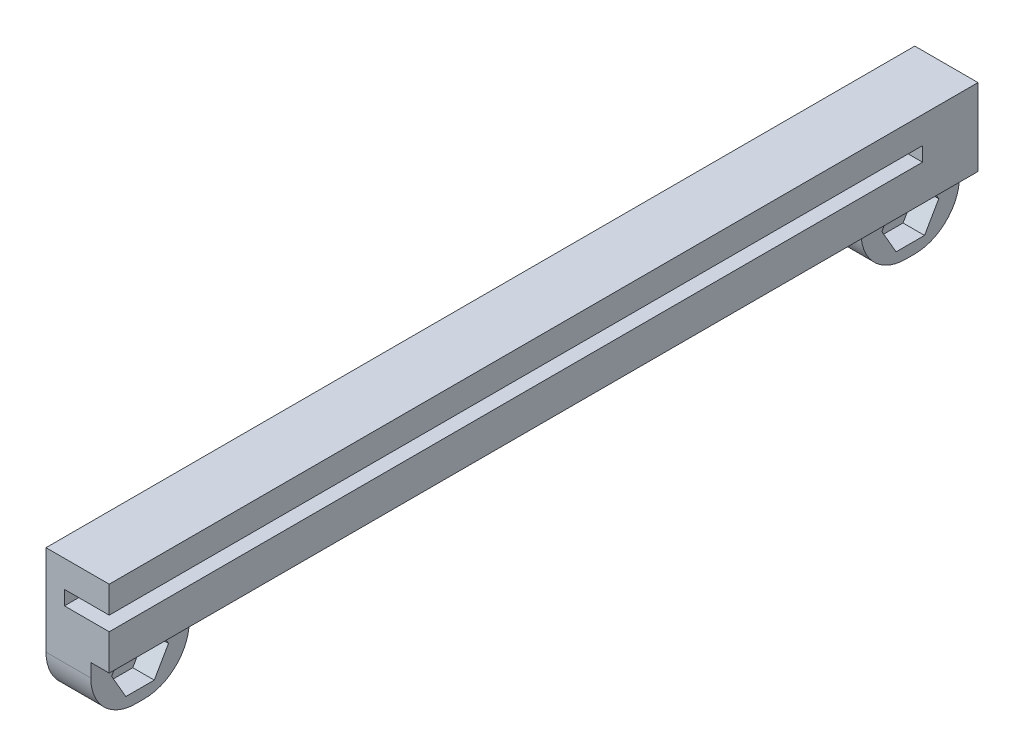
ISO-10303-21;
HEADER;
FILE_DESCRIPTION(('STEP AP214'),'2;1');
FILE_NAME('part.step','',(''),(''),'','','');
FILE_SCHEMA(('AUTOMOTIVE_DESIGN { 1 0 10303 214 1 1 1 1 }'));
ENDSEC;
DATA;
#1=APPLICATION_CONTEXT('core data for automotive mechanical design processes');
#2=APPLICATION_PROTOCOL_DEFINITION('international standard','automotive_design',2000,#1);
#3=PRODUCT_CONTEXT('',#1,'mechanical');
#4=PRODUCT('Part','Part','',(#3));
#5=PRODUCT_RELATED_PRODUCT_CATEGORY('part','',(#4));
#6=PRODUCT_DEFINITION_FORMATION('','',#4);
#7=PRODUCT_DEFINITION_CONTEXT('part definition',#1,'design');
#8=PRODUCT_DEFINITION('design','',#6,#7);
#9=PRODUCT_DEFINITION_SHAPE('','',#8);
#10=(LENGTH_UNIT() NAMED_UNIT(*) SI_UNIT(.MILLI.,.METRE.));
#11=(NAMED_UNIT(*) PLANE_ANGLE_UNIT() SI_UNIT($,.RADIAN.));
#12=(NAMED_UNIT(*) SI_UNIT($,.STERADIAN.) SOLID_ANGLE_UNIT());
#13=UNCERTAINTY_MEASURE_WITH_UNIT(LENGTH_MEASURE(1.E-05),#10,'distance_accuracy_value','');
#14=(GEOMETRIC_REPRESENTATION_CONTEXT(3) GLOBAL_UNCERTAINTY_ASSIGNED_CONTEXT((#13)) GLOBAL_UNIT_ASSIGNED_CONTEXT((#10,
#11,#12)) REPRESENTATION_CONTEXT('',''));
#15=CARTESIAN_POINT('',(0.,0.,0.));
#16=DIRECTION('',(0.,0.,1.));
#17=DIRECTION('',(1.,0.,0.));
#18=AXIS2_PLACEMENT_3D('',#15,#16,#17);
#19=CARTESIAN_POINT('',(3.52875,7.6,48.5));
#20=DIRECTION('',(-1.,0.,0.));
#21=DIRECTION('',(0.,0.,1.));
#22=AXIS2_PLACEMENT_3D('',#19,#20,#21);
#23=PLANE('',#22);
#24=DIRECTION('',(0.,0.,-1.));
#25=VECTOR('',#24,1.);
#26=CARTESIAN_POINT('',(3.52875,7.6,48.5));
#27=LINE('',#26,#25);
#28=CARTESIAN_POINT('',(3.52875000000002,7.6,48.5));
#29=VERTEX_POINT('',#28);
#30=CARTESIAN_POINT('',(3.52875,7.6,-48.5));
#31=VERTEX_POINT('',#30);
#32=EDGE_CURVE('E505',#29,#31,#27,.T.);
#33=ORIENTED_EDGE('',*,*,#32,.F.);
#34=DIRECTION('',(0.,1.,0.));
#35=VECTOR('',#34,1.);
#36=CARTESIAN_POINT('',(3.52875000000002,4.6,48.5));
#37=LINE('',#36,#35);
#38=CARTESIAN_POINT('',(3.52875000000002,4.6,48.5));
#39=VERTEX_POINT('',#38);
#40=EDGE_CURVE('E481',#39,#29,#37,.T.);
#41=ORIENTED_EDGE('',*,*,#40,.F.);
#42=DIRECTION('',(0.,0.,-1.));
#43=VECTOR('',#42,1.);
#44=CARTESIAN_POINT('',(3.52875,4.6,-42.305));
#45=LINE('',#44,#43);
#46=CARTESIAN_POINT('',(3.52875,4.6,-42.305));
#47=VERTEX_POINT('',#46);
#48=EDGE_CURVE('E467',#39,#47,#45,.T.);
#49=ORIENTED_EDGE('',*,*,#48,.T.);
#50=DIRECTION('',(0.,1.,0.));
#51=VECTOR('',#50,1.);
#52=CARTESIAN_POINT('',(3.52875,3.,-42.305));
#53=LINE('',#52,#51);
#54=CARTESIAN_POINT('',(3.52875,3.,-42.305));
#55=VERTEX_POINT('',#54);
#56=EDGE_CURVE('E500',#55,#47,#53,.T.);
#57=ORIENTED_EDGE('',*,*,#56,.F.);
#58=DIRECTION('',(0.,0.,-1.));
#59=VECTOR('',#58,1.);
#60=CARTESIAN_POINT('',(3.52875,3.,-42.305));
#61=LINE('',#60,#59);
#62=CARTESIAN_POINT('',(3.52875000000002,3.,48.5));
#63=VERTEX_POINT('',#62);
#64=EDGE_CURVE('E485',#63,#55,#61,.T.);
#65=ORIENTED_EDGE('',*,*,#64,.F.);
#66=DIRECTION('',(0.,-1.,0.));
#67=VECTOR('',#66,1.);
#68=CARTESIAN_POINT('',(3.52875,7.6,48.5));
#69=LINE('',#68,#67);
#70=CARTESIAN_POINT('',(3.52874999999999,-1.,48.5));
#71=VERTEX_POINT('',#70);
#72=EDGE_CURVE('E523',#63,#71,#69,.T.);
#73=ORIENTED_EDGE('',*,*,#72,.T.);
#74=DIRECTION('',(0.,0.,1.));
#75=VECTOR('',#74,1.);
#76=CARTESIAN_POINT('',(3.52874999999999,-1.,48.5));
#77=LINE('',#76,#75);
#78=CARTESIAN_POINT('',(3.52875,-1.,-48.5));
#79=VERTEX_POINT('',#78);
#80=EDGE_CURVE('E459',#79,#71,#77,.T.);
#81=ORIENTED_EDGE('',*,*,#80,.F.);
#82=DIRECTION('',(0.,-1.,0.));
#83=VECTOR('',#82,1.);
#84=CARTESIAN_POINT('',(3.52875,7.6,-48.5));
#85=LINE('',#84,#83);
#86=EDGE_CURVE('E534',#31,#79,#85,.T.);
#87=ORIENTED_EDGE('',*,*,#86,.F.);
#88=EDGE_LOOP('',(#33,#41,#49,#57,#65,#73,#81,#87));
#89=FACE_BOUND('',#88,.T.);
#90=ADVANCED_FACE('F38',(#89),#23,.F.);
#91=CARTESIAN_POINT('',(-3.52875000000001,7.6,-48.5));
#92=DIRECTION('',(0.,0.,1.));
#93=DIRECTION('',(1.,0.,0.));
#94=AXIS2_PLACEMENT_3D('',#91,#92,#93);
#95=PLANE('',#94);
#96=DIRECTION('',(0.,1.,0.));
#97=VECTOR('',#96,1.);
#98=CARTESIAN_POINT('',(1.47125,-7.5,-48.5));
#99=LINE('',#98,#97);
#100=CARTESIAN_POINT('',(1.47125,-2.5,-48.5));
#101=VERTEX_POINT('',#100);
#102=CARTESIAN_POINT('',(1.47125,-1.,-48.5));
#103=VERTEX_POINT('',#102);
#104=EDGE_CURVE('E404',#101,#103,#99,.T.);
#105=ORIENTED_EDGE('',*,*,#104,.F.);
#106=DIRECTION('',(1.,0.,0.));
#107=VECTOR('',#106,1.);
#108=CARTESIAN_POINT('',(-3.52875,-2.5,-48.5));
#109=LINE('',#108,#107);
#110=CARTESIAN_POINT('',(-3.52875000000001,-2.5,-48.5));
#111=VERTEX_POINT('',#110);
#112=EDGE_CURVE('E558',#101,#111,#109,.F.);
#113=ORIENTED_EDGE('',*,*,#112,.T.);
#114=DIRECTION('',(0.,-1.,0.));
#115=VECTOR('',#114,1.);
#116=CARTESIAN_POINT('',(-3.52875000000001,7.6,-48.5));
#117=LINE('',#116,#115);
#118=CARTESIAN_POINT('',(-3.52875000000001,7.6,-48.5));
#119=VERTEX_POINT('',#118);
#120=EDGE_CURVE('E530',#119,#111,#117,.T.);
#121=ORIENTED_EDGE('',*,*,#120,.F.);
#122=DIRECTION('',(-1.,0.,0.));
#123=VECTOR('',#122,1.);
#124=CARTESIAN_POINT('',(-3.52875000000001,7.6,-48.5));
#125=LINE('',#124,#123);
#126=EDGE_CURVE('E514',#31,#119,#125,.T.);
#127=ORIENTED_EDGE('',*,*,#126,.F.);
#128=ORIENTED_EDGE('',*,*,#86,.T.);
#129=DIRECTION('',(1.,0.,0.));
#130=VECTOR('',#129,1.);
#131=CARTESIAN_POINT('',(-3.52875,-1.,-48.5));
#132=LINE('',#131,#130);
#133=EDGE_CURVE('E456',#103,#79,#132,.T.);
#134=ORIENTED_EDGE('',*,*,#133,.F.);
#135=EDGE_LOOP('',(#105,#113,#121,#127,#128,#134));
#136=FACE_BOUND('',#135,.T.);
#137=ADVANCED_FACE('F627',(#136),#95,.F.);
#138=CARTESIAN_POINT('',(-3.52875000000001,7.6,48.5));
#139=DIRECTION('',(1.,0.,0.));
#140=DIRECTION('',(0.,0.,-1.));
#141=AXIS2_PLACEMENT_3D('',#138,#139,#140);
#142=PLANE('',#141);
#143=CARTESIAN_POINT('',(-3.52875000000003,-3.5,43.));
#144=DIRECTION('',(1.,0.,0.));
#145=DIRECTION('',(0.,0.,-1.));
#146=AXIS2_PLACEMENT_3D('',#143,#144,#145);
#147=CIRCLE('',#146,1.6);
#148=CARTESIAN_POINT('',(-3.52875000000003,-3.5,41.4));
#149=VERTEX_POINT('',#148);
#150=EDGE_CURVE('E361',#149,#149,#147,.T.);
#151=ORIENTED_EDGE('',*,*,#150,.T.);
#152=EDGE_LOOP('',(#151));
#153=FACE_BOUND('',#152,.T.);
#154=CARTESIAN_POINT('',(-3.52875000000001,-3.5,-43.));
#155=DIRECTION('',(1.,0.,0.));
#156=DIRECTION('',(0.,0.,-1.));
#157=AXIS2_PLACEMENT_3D('',#154,#155,#156);
#158=CIRCLE('',#157,1.6);
#159=CARTESIAN_POINT('',(-3.52875000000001,-3.5,-44.6));
#160=VERTEX_POINT('',#159);
#161=EDGE_CURVE('E284',#160,#160,#158,.T.);
#162=ORIENTED_EDGE('',*,*,#161,.T.);
#163=EDGE_LOOP('',(#162));
#164=FACE_BOUND('',#163,.T.);
#165=ORIENTED_EDGE('',*,*,#120,.T.);
#166=CARTESIAN_POINT('',(-3.52875000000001,-2.5,-43.5));
#167=DIRECTION('',(1.,0.,0.));
#168=DIRECTION('',(0.,0.,-1.));
#169=AXIS2_PLACEMENT_3D('',#166,#167,#168);
#170=CIRCLE('',#169,5.);
#171=CARTESIAN_POINT('',(-3.52875,-7.5,-43.5));
#172=VERTEX_POINT('',#171);
#173=EDGE_CURVE('E570',#111,#172,#170,.F.);
#174=ORIENTED_EDGE('',*,*,#173,.T.);
#175=DIRECTION('',(0.,0.,1.));
#176=VECTOR('',#175,1.);
#177=CARTESIAN_POINT('',(-3.52875,-7.5,-48.5));
#178=LINE('',#177,#176);
#179=CARTESIAN_POINT('',(-3.52875,-7.5,-42.5));
#180=VERTEX_POINT('',#179);
#181=EDGE_CURVE('E403',#172,#180,#178,.T.);
#182=ORIENTED_EDGE('',*,*,#181,.T.);
#183=CARTESIAN_POINT('',(-3.52875000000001,-2.5,-42.5));
#184=DIRECTION('',(1.,0.,0.));
#185=DIRECTION('',(0.,0.,-1.));
#186=AXIS2_PLACEMENT_3D('',#183,#184,#185);
#187=CIRCLE('',#186,5.);
#188=CARTESIAN_POINT('',(-3.52875,-2.5,-37.5));
#189=VERTEX_POINT('',#188);
#190=EDGE_CURVE('E567',#180,#189,#187,.F.);
#191=ORIENTED_EDGE('',*,*,#190,.T.);
#192=DIRECTION('',(0.,1.,0.));
#193=VECTOR('',#192,1.);
#194=CARTESIAN_POINT('',(-3.52875,-7.5,-37.5));
#195=LINE('',#194,#193);
#196=CARTESIAN_POINT('',(-3.52875,-1.,-37.5));
#197=VERTEX_POINT('',#196);
#198=EDGE_CURVE('E319',#189,#197,#195,.T.);
#199=ORIENTED_EDGE('',*,*,#198,.T.);
#200=DIRECTION('',(0.,0.,-1.));
#201=VECTOR('',#200,1.);
#202=CARTESIAN_POINT('',(-3.52875000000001,-1.,48.5));
#203=LINE('',#202,#201);
#204=CARTESIAN_POINT('',(-3.52875000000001,-1.,37.5));
#205=VERTEX_POINT('',#204);
#206=EDGE_CURVE('E452',#205,#197,#203,.T.);
#207=ORIENTED_EDGE('',*,*,#206,.F.);
#208=DIRECTION('',(0.,1.,0.));
#209=VECTOR('',#208,1.);
#210=CARTESIAN_POINT('',(-3.52875000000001,-7.5,37.5));
#211=LINE('',#210,#209);
#212=CARTESIAN_POINT('',(-3.52875000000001,-2.5,37.5));
#213=VERTEX_POINT('',#212);
#214=EDGE_CURVE('E435',#213,#205,#211,.T.);
#215=ORIENTED_EDGE('',*,*,#214,.F.);
#216=CARTESIAN_POINT('',(-3.52875000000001,-2.5,42.5));
#217=DIRECTION('',(1.,0.,0.));
#218=DIRECTION('',(0.,0.,-1.));
#219=AXIS2_PLACEMENT_3D('',#216,#217,#218);
#220=CIRCLE('',#219,5.);
#221=CARTESIAN_POINT('',(-3.52875000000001,-7.5,42.5));
#222=VERTEX_POINT('',#221);
#223=EDGE_CURVE('E564',#213,#222,#220,.F.);
#224=ORIENTED_EDGE('',*,*,#223,.T.);
#225=DIRECTION('',(0.,0.,-1.));
#226=VECTOR('',#225,1.);
#227=CARTESIAN_POINT('',(-3.52875000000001,-7.5,48.5));
#228=LINE('',#227,#226);
#229=CARTESIAN_POINT('',(-3.52875000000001,-7.5,43.5));
#230=VERTEX_POINT('',#229);
#231=EDGE_CURVE('E430',#230,#222,#228,.T.);
#232=ORIENTED_EDGE('',*,*,#231,.F.);
#233=CARTESIAN_POINT('',(-3.52875000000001,-2.5,43.5));
#234=DIRECTION('',(1.,0.,0.));
#235=DIRECTION('',(0.,0.,-1.));
#236=AXIS2_PLACEMENT_3D('',#233,#234,#235);
#237=CIRCLE('',#236,5.);
#238=CARTESIAN_POINT('',(-3.52875000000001,-2.5,48.5));
#239=VERTEX_POINT('',#238);
#240=EDGE_CURVE('E561',#230,#239,#237,.F.);
#241=ORIENTED_EDGE('',*,*,#240,.T.);
#242=DIRECTION('',(0.,-1.,0.));
#243=VECTOR('',#242,1.);
#244=CARTESIAN_POINT('',(-3.52875000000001,7.6,48.5));
#245=LINE('',#244,#243);
#246=CARTESIAN_POINT('',(-3.52875000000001,7.6,48.5));
#247=VERTEX_POINT('',#246);
#248=EDGE_CURVE('E526',#247,#239,#245,.T.);
#249=ORIENTED_EDGE('',*,*,#248,.F.);
#250=DIRECTION('',(0.,0.,1.));
#251=VECTOR('',#250,1.);
#252=CARTESIAN_POINT('',(-3.52875000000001,7.6,48.5));
#253=LINE('',#252,#251);
#254=EDGE_CURVE('E517',#119,#247,#253,.T.);
#255=ORIENTED_EDGE('',*,*,#254,.F.);
#256=EDGE_LOOP('',(#165,#174,#182,#191,#199,#207,#215,#224,#232,#241,#249,#255));
#257=FACE_BOUND('',#256,.T.);
#258=ADVANCED_FACE('F597',(#153,#164,#257),#142,.F.);
#259=CARTESIAN_POINT('',(-3.52875000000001,7.6,48.5));
#260=DIRECTION('',(0.,0.,-1.));
#261=DIRECTION('',(-1.,0.,0.));
#262=AXIS2_PLACEMENT_3D('',#259,#260,#261);
#263=PLANE('',#262);
#264=ORIENTED_EDGE('',*,*,#248,.T.);
#265=DIRECTION('',(1.,0.,0.));
#266=VECTOR('',#265,1.);
#267=CARTESIAN_POINT('',(-3.52875000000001,-2.5,48.5));
#268=LINE('',#267,#266);
#269=CARTESIAN_POINT('',(1.47124999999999,-2.5,48.5));
#270=VERTEX_POINT('',#269);
#271=EDGE_CURVE('E11',#239,#270,#268,.T.);
#272=ORIENTED_EDGE('',*,*,#271,.T.);
#273=DIRECTION('',(0.,1.,0.));
#274=VECTOR('',#273,1.);
#275=CARTESIAN_POINT('',(1.47124999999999,-7.5,48.5));
#276=LINE('',#275,#274);
#277=CARTESIAN_POINT('',(1.47124999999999,-1.,48.5));
#278=VERTEX_POINT('',#277);
#279=EDGE_CURVE('E446',#270,#278,#276,.T.);
#280=ORIENTED_EDGE('',*,*,#279,.T.);
#281=DIRECTION('',(-1.,0.,0.));
#282=VECTOR('',#281,1.);
#283=CARTESIAN_POINT('',(-3.52875000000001,-1.,48.5));
#284=LINE('',#283,#282);
#285=EDGE_CURVE('E463',#71,#278,#284,.T.);
#286=ORIENTED_EDGE('',*,*,#285,.F.);
#287=ORIENTED_EDGE('',*,*,#72,.F.);
#288=DIRECTION('',(1.,0.,0.));
#289=VECTOR('',#288,1.);
#290=CARTESIAN_POINT('',(3.52875000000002,3.,48.5));
#291=LINE('',#290,#289);
#292=CARTESIAN_POINT('',(-1.47125000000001,3.,48.5));
#293=VERTEX_POINT('',#292);
#294=EDGE_CURVE('E497',#293,#63,#291,.T.);
#295=ORIENTED_EDGE('',*,*,#294,.F.);
#296=DIRECTION('',(0.,1.,0.));
#297=VECTOR('',#296,1.);
#298=CARTESIAN_POINT('',(-1.47125000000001,3.,48.5));
#299=LINE('',#298,#297);
#300=CARTESIAN_POINT('',(-1.47125000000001,4.6,48.5));
#301=VERTEX_POINT('',#300);
#302=EDGE_CURVE('E501',#293,#301,#299,.T.);
#303=ORIENTED_EDGE('',*,*,#302,.T.);
#304=DIRECTION('',(1.,0.,0.));
#305=VECTOR('',#304,1.);
#306=CARTESIAN_POINT('',(3.52875000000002,4.6,48.5));
#307=LINE('',#306,#305);
#308=EDGE_CURVE('E477',#301,#39,#307,.T.);
#309=ORIENTED_EDGE('',*,*,#308,.T.);
#310=ORIENTED_EDGE('',*,*,#40,.T.);
#311=DIRECTION('',(1.,0.,0.));
#312=VECTOR('',#311,1.);
#313=CARTESIAN_POINT('',(-3.52875000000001,7.6,48.5));
#314=LINE('',#313,#312);
#315=EDGE_CURVE('E520',#247,#29,#314,.T.);
#316=ORIENTED_EDGE('',*,*,#315,.F.);
#317=EDGE_LOOP('',(#264,#272,#280,#286,#287,#295,#303,#309,#310,#316));
#318=FACE_BOUND('',#317,.T.);
#319=ADVANCED_FACE('F610',(#318),#263,.F.);
#320=CARTESIAN_POINT('',(0.,7.6,0.));
#321=DIRECTION('',(0.,-1.,0.));
#322=DIRECTION('',(0.,0.,-1.));
#323=AXIS2_PLACEMENT_3D('',#320,#321,#322);
#324=PLANE('',#323);
#325=ORIENTED_EDGE('',*,*,#315,.T.);
#326=ORIENTED_EDGE('',*,*,#32,.T.);
#327=ORIENTED_EDGE('',*,*,#126,.T.);
#328=ORIENTED_EDGE('',*,*,#254,.T.);
#329=EDGE_LOOP('',(#325,#326,#327,#328));
#330=FACE_BOUND('',#329,.T.);
#331=ADVANCED_FACE('F618',(#330),#324,.F.);
#332=CARTESIAN_POINT('',(-1.47125000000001,3.,-42.305));
#333=DIRECTION('',(-1.,0.,0.));
#334=DIRECTION('',(0.,0.,1.));
#335=AXIS2_PLACEMENT_3D('',#332,#333,#334);
#336=PLANE('',#335);
#337=DIRECTION('',(0.,1.,0.));
#338=VECTOR('',#337,1.);
#339=CARTESIAN_POINT('',(-1.47125000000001,3.,-42.305));
#340=LINE('',#339,#338);
#341=CARTESIAN_POINT('',(-1.47125000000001,3.,-42.305));
#342=VERTEX_POINT('',#341);
#343=CARTESIAN_POINT('',(-1.47125000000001,4.6,-42.305));
#344=VERTEX_POINT('',#343);
#345=EDGE_CURVE('E506',#342,#344,#340,.T.);
#346=ORIENTED_EDGE('',*,*,#345,.T.);
#347=DIRECTION('',(0.,0.,1.));
#348=VECTOR('',#347,1.);
#349=CARTESIAN_POINT('',(-1.47125000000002,4.6,-42.305));
#350=LINE('',#349,#348);
#351=EDGE_CURVE('E474',#344,#301,#350,.T.);
#352=ORIENTED_EDGE('',*,*,#351,.T.);
#353=ORIENTED_EDGE('',*,*,#302,.F.);
#354=DIRECTION('',(0.,0.,1.));
#355=VECTOR('',#354,1.);
#356=CARTESIAN_POINT('',(-1.47125000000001,3.,-42.305));
#357=LINE('',#356,#355);
#358=EDGE_CURVE('E493',#342,#293,#357,.T.);
#359=ORIENTED_EDGE('',*,*,#358,.F.);
#360=EDGE_LOOP('',(#346,#352,#353,#359));
#361=FACE_BOUND('',#360,.T.);
#362=ADVANCED_FACE('F997',(#361),#336,.F.);
#363=CARTESIAN_POINT('',(3.52875,3.,-42.305));
#364=DIRECTION('',(0.,0.,-1.));
#365=DIRECTION('',(-1.,0.,0.));
#366=AXIS2_PLACEMENT_3D('',#363,#364,#365);
#367=PLANE('',#366);
#368=ORIENTED_EDGE('',*,*,#56,.T.);
#369=DIRECTION('',(-1.,0.,0.));
#370=VECTOR('',#369,1.);
#371=CARTESIAN_POINT('',(3.52875,4.6,-42.305));
#372=LINE('',#371,#370);
#373=EDGE_CURVE('E471',#47,#344,#372,.T.);
#374=ORIENTED_EDGE('',*,*,#373,.T.);
#375=ORIENTED_EDGE('',*,*,#345,.F.);
#376=DIRECTION('',(-1.,0.,0.));
#377=VECTOR('',#376,1.);
#378=CARTESIAN_POINT('',(3.52875,3.,-42.305));
#379=LINE('',#378,#377);
#380=EDGE_CURVE('E489',#55,#342,#379,.T.);
#381=ORIENTED_EDGE('',*,*,#380,.F.);
#382=EDGE_LOOP('',(#368,#374,#375,#381));
#383=FACE_BOUND('',#382,.T.);
#384=ADVANCED_FACE('F992',(#383),#367,.F.);
#385=CARTESIAN_POINT('',(0.,3.,0.));
#386=DIRECTION('',(0.,-1.,0.));
#387=DIRECTION('',(0.,0.,-1.));
#388=AXIS2_PLACEMENT_3D('',#385,#386,#387);
#389=PLANE('',#388);
#390=ORIENTED_EDGE('',*,*,#64,.T.);
#391=ORIENTED_EDGE('',*,*,#380,.T.);
#392=ORIENTED_EDGE('',*,*,#358,.T.);
#393=ORIENTED_EDGE('',*,*,#294,.T.);
#394=EDGE_LOOP('',(#390,#391,#392,#393));
#395=FACE_BOUND('',#394,.T.);
#396=ADVANCED_FACE('F984',(#395),#389,.F.);
#397=CARTESIAN_POINT('',(0.,4.6,0.));
#398=DIRECTION('',(0.,-1.,0.));
#399=DIRECTION('',(0.,0.,-1.));
#400=AXIS2_PLACEMENT_3D('',#397,#398,#399);
#401=PLANE('',#400);
#402=ORIENTED_EDGE('',*,*,#48,.F.);
#403=ORIENTED_EDGE('',*,*,#308,.F.);
#404=ORIENTED_EDGE('',*,*,#351,.F.);
#405=ORIENTED_EDGE('',*,*,#373,.F.);
#406=EDGE_LOOP('',(#402,#403,#404,#405));
#407=FACE_BOUND('',#406,.T.);
#408=ADVANCED_FACE('F969',(#407),#401,.T.);
#409=CARTESIAN_POINT('',(0.,-1.,0.));
#410=DIRECTION('',(0.,-1.,0.));
#411=DIRECTION('',(0.,0.,-1.));
#412=AXIS2_PLACEMENT_3D('',#409,#410,#411);
#413=PLANE('',#412);
#414=DIRECTION('',(1.,0.,0.));
#415=VECTOR('',#414,1.);
#416=CARTESIAN_POINT('',(-3.52875,-1.,-37.5));
#417=LINE('',#416,#415);
#418=CARTESIAN_POINT('',(1.47125,-1.,-37.5));
#419=VERTEX_POINT('',#418);
#420=EDGE_CURVE('E413',#197,#419,#417,.T.);
#421=ORIENTED_EDGE('',*,*,#420,.T.);
#422=DIRECTION('',(0.,0.,1.));
#423=VECTOR('',#422,1.);
#424=CARTESIAN_POINT('',(1.47125,-1.,-48.5));
#425=LINE('',#424,#423);
#426=CARTESIAN_POINT('',(1.47125000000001,-1.,-41.2679491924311));
#427=VERTEX_POINT('',#426);
#428=EDGE_CURVE('E415',#427,#419,#425,.T.);
#429=ORIENTED_EDGE('',*,*,#428,.F.);
#430=CARTESIAN_POINT('',(1.47125000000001,-1.,-44.7320508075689));
#431=VERTEX_POINT('',#430);
#432=EDGE_CURVE('E414',#431,#427,#425,.T.);
#433=ORIENTED_EDGE('',*,*,#432,.F.);
#434=EDGE_CURVE('E409',#103,#431,#425,.T.);
#435=ORIENTED_EDGE('',*,*,#434,.F.);
#436=ORIENTED_EDGE('',*,*,#133,.T.);
#437=ORIENTED_EDGE('',*,*,#80,.T.);
#438=ORIENTED_EDGE('',*,*,#285,.T.);
#439=DIRECTION('',(0.,0.,-1.));
#440=VECTOR('',#439,1.);
#441=CARTESIAN_POINT('',(1.47124999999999,-1.,48.5));
#442=LINE('',#441,#440);
#443=CARTESIAN_POINT('',(1.47124999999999,-1.,44.7320508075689));
#444=VERTEX_POINT('',#443);
#445=EDGE_CURVE('E431',#278,#444,#442,.T.);
#446=ORIENTED_EDGE('',*,*,#445,.T.);
#447=CARTESIAN_POINT('',(1.47124999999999,-1.,41.2679491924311));
#448=VERTEX_POINT('',#447);
#449=EDGE_CURVE('E443',#444,#448,#442,.T.);
#450=ORIENTED_EDGE('',*,*,#449,.T.);
#451=CARTESIAN_POINT('',(1.47124999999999,-1.,37.5));
#452=VERTEX_POINT('',#451);
#453=EDGE_CURVE('E439',#448,#452,#442,.T.);
#454=ORIENTED_EDGE('',*,*,#453,.T.);
#455=DIRECTION('',(1.,0.,0.));
#456=VECTOR('',#455,1.);
#457=CARTESIAN_POINT('',(-3.52875000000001,-1.,37.5));
#458=LINE('',#457,#456);
#459=EDGE_CURVE('E419',#205,#452,#458,.T.);
#460=ORIENTED_EDGE('',*,*,#459,.F.);
#461=ORIENTED_EDGE('',*,*,#206,.T.);
#462=EDGE_LOOP('',(#421,#429,#433,#435,#436,#437,#438,#446,#450,#454,#460,#461));
#463=FACE_BOUND('',#462,.T.);
#464=ADVANCED_FACE('F653',(#463),#413,.T.);
#465=CARTESIAN_POINT('',(-3.52875000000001,-7.5,37.5));
#466=DIRECTION('',(0.,0.,1.));
#467=DIRECTION('',(1.,0.,0.));
#468=AXIS2_PLACEMENT_3D('',#465,#466,#467);
#469=PLANE('',#468);
#470=DIRECTION('',(0.,1.,0.));
#471=VECTOR('',#470,1.);
#472=CARTESIAN_POINT('',(1.47124999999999,-7.5,37.5));
#473=LINE('',#472,#471);
#474=CARTESIAN_POINT('',(1.47124999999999,-2.5,37.5));
#475=VERTEX_POINT('',#474);
#476=EDGE_CURVE('E449',#475,#452,#473,.T.);
#477=ORIENTED_EDGE('',*,*,#476,.F.);
#478=DIRECTION('',(1.,0.,0.));
#479=VECTOR('',#478,1.);
#480=CARTESIAN_POINT('',(-3.52875000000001,-2.5,37.5));
#481=LINE('',#480,#479);
#482=EDGE_CURVE('E47',#475,#213,#481,.F.);
#483=ORIENTED_EDGE('',*,*,#482,.T.);
#484=ORIENTED_EDGE('',*,*,#214,.T.);
#485=ORIENTED_EDGE('',*,*,#459,.T.);
#486=EDGE_LOOP('',(#477,#483,#484,#485));
#487=FACE_BOUND('',#486,.T.);
#488=ADVANCED_FACE('F591',(#487),#469,.F.);
#489=CARTESIAN_POINT('',(1.47124999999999,-7.5,48.5));
#490=DIRECTION('',(1.,0.,0.));
#491=DIRECTION('',(0.,0.,-1.));
#492=AXIS2_PLACEMENT_3D('',#489,#490,#491);
#493=PLANE('',#492);
#494=DIRECTION('',(0.,0.,-1.));
#495=VECTOR('',#494,1.);
#496=CARTESIAN_POINT('',(1.47124999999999,-7.5,48.5));
#497=LINE('',#496,#495);
#498=CARTESIAN_POINT('',(1.47124999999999,-7.5,43.5));
#499=VERTEX_POINT('',#498);
#500=CARTESIAN_POINT('',(1.47124999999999,-7.5,42.5));
#501=VERTEX_POINT('',#500);
#502=EDGE_CURVE('E427',#499,#501,#497,.T.);
#503=ORIENTED_EDGE('',*,*,#502,.T.);
#504=CARTESIAN_POINT('',(1.47124999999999,-2.5,42.5));
#505=DIRECTION('',(1.,0.,0.));
#506=DIRECTION('',(0.,0.,-1.));
#507=AXIS2_PLACEMENT_3D('',#504,#505,#506);
#508=CIRCLE('',#507,5.);
#509=EDGE_CURVE('E54',#501,#475,#508,.T.);
#510=ORIENTED_EDGE('',*,*,#509,.T.);
#511=ORIENTED_EDGE('',*,*,#476,.T.);
#512=ORIENTED_EDGE('',*,*,#453,.F.);
#513=DIRECTION('',(0.,0.866025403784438,0.5));
#514=VECTOR('',#513,1.);
#515=CARTESIAN_POINT('',(1.47124999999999,-3.49999999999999,39.8245735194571));
#516=LINE('',#515,#514);
#517=CARTESIAN_POINT('',(1.47124999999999,-3.49999999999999,39.8245735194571));
#518=VERTEX_POINT('',#517);
#519=EDGE_CURVE('E277',#518,#448,#516,.T.);
#520=ORIENTED_EDGE('',*,*,#519,.F.);
#521=DIRECTION('',(0.,0.866025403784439,-0.5));
#522=VECTOR('',#521,1.);
#523=CARTESIAN_POINT('',(1.47124999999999,-6.25,41.4122867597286));
#524=LINE('',#523,#522);
#525=CARTESIAN_POINT('',(1.47124999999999,-6.25,41.4122867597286));
#526=VERTEX_POINT('',#525);
#527=EDGE_CURVE('E312',#526,#518,#524,.T.);
#528=ORIENTED_EDGE('',*,*,#527,.F.);
#529=DIRECTION('',(0.,0.,-1.));
#530=VECTOR('',#529,1.);
#531=CARTESIAN_POINT('',(1.47124999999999,-6.25,44.5877132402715));
#532=LINE('',#531,#530);
#533=CARTESIAN_POINT('',(1.47124999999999,-6.25,44.5877132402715));
#534=VERTEX_POINT('',#533);
#535=EDGE_CURVE('E308',#534,#526,#532,.T.);
#536=ORIENTED_EDGE('',*,*,#535,.F.);
#537=DIRECTION('',(0.,-0.866025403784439,-0.5));
#538=VECTOR('',#537,1.);
#539=CARTESIAN_POINT('',(1.47124999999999,-3.49999999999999,46.175426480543));
#540=LINE('',#539,#538);
#541=CARTESIAN_POINT('',(1.47124999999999,-3.49999999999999,46.175426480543));
#542=VERTEX_POINT('',#541);
#543=EDGE_CURVE('E304',#542,#534,#540,.T.);
#544=ORIENTED_EDGE('',*,*,#543,.F.);
#545=DIRECTION('',(0.,-0.866025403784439,0.5));
#546=VECTOR('',#545,1.);
#547=CARTESIAN_POINT('',(1.47124999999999,-7.5065698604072,48.4886206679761));
#548=LINE('',#547,#546);
#549=EDGE_CURVE('E542',#444,#542,#548,.T.);
#550=ORIENTED_EDGE('',*,*,#549,.F.);
#551=ORIENTED_EDGE('',*,*,#445,.F.);
#552=ORIENTED_EDGE('',*,*,#279,.F.);
#553=CARTESIAN_POINT('',(1.47124999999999,-2.5,43.5));
#554=DIRECTION('',(1.,0.,0.));
#555=DIRECTION('',(0.,0.,-1.));
#556=AXIS2_PLACEMENT_3D('',#553,#554,#555);
#557=CIRCLE('',#556,5.);
#558=EDGE_CURVE('E62',#270,#499,#557,.T.);
#559=ORIENTED_EDGE('',*,*,#558,.T.);
#560=EDGE_LOOP('',(#503,#510,#511,#512,#520,#528,#536,#544,#550,#551,#552,#559));
#561=FACE_BOUND('',#560,.T.);
#562=ADVANCED_FACE('F604',(#561),#493,.T.);
#563=CARTESIAN_POINT('',(0.,-7.5,0.));
#564=DIRECTION('',(0.,1.,0.));
#565=DIRECTION('',(0.,0.,1.));
#566=AXIS2_PLACEMENT_3D('',#563,#564,#565);
#567=PLANE('',#566);
#568=ORIENTED_EDGE('',*,*,#231,.T.);
#569=DIRECTION('',(1.,0.,0.));
#570=VECTOR('',#569,1.);
#571=CARTESIAN_POINT('',(0.,-7.5,42.5));
#572=LINE('',#571,#570);
#573=EDGE_CURVE('E580',#222,#501,#572,.T.);
#574=ORIENTED_EDGE('',*,*,#573,.T.);
#575=ORIENTED_EDGE('',*,*,#502,.F.);
#576=DIRECTION('',(1.,0.,0.));
#577=VECTOR('',#576,1.);
#578=CARTESIAN_POINT('',(0.,-7.5,43.5));
#579=LINE('',#578,#577);
#580=EDGE_CURVE('E577',#499,#230,#579,.F.);
#581=ORIENTED_EDGE('',*,*,#580,.T.);
#582=EDGE_LOOP('',(#568,#574,#575,#581));
#583=FACE_BOUND('',#582,.T.);
#584=ADVANCED_FACE('F603',(#583),#567,.F.);
#585=CARTESIAN_POINT('',(-3.52875,-7.5,-37.5));
#586=DIRECTION('',(0.,0.,1.));
#587=DIRECTION('',(1.,0.,0.));
#588=AXIS2_PLACEMENT_3D('',#585,#586,#587);
#589=PLANE('',#588);
#590=ORIENTED_EDGE('',*,*,#198,.F.);
#591=DIRECTION('',(1.,0.,0.));
#592=VECTOR('',#591,1.);
#593=CARTESIAN_POINT('',(-3.52875,-2.5,-37.5));
#594=LINE('',#593,#592);
#595=CARTESIAN_POINT('',(1.47125,-2.5,-37.5));
#596=VERTEX_POINT('',#595);
#597=EDGE_CURVE('E573',#189,#596,#594,.T.);
#598=ORIENTED_EDGE('',*,*,#597,.T.);
#599=DIRECTION('',(0.,1.,0.));
#600=VECTOR('',#599,1.);
#601=CARTESIAN_POINT('',(1.47125,-7.5,-37.5));
#602=LINE('',#601,#600);
#603=EDGE_CURVE('E400',#596,#419,#602,.T.);
#604=ORIENTED_EDGE('',*,*,#603,.T.);
#605=ORIENTED_EDGE('',*,*,#420,.F.);
#606=EDGE_LOOP('',(#590,#598,#604,#605));
#607=FACE_BOUND('',#606,.T.);
#608=ADVANCED_FACE('F649',(#607),#589,.T.);
#609=CARTESIAN_POINT('',(1.47125,-7.5,-48.5));
#610=DIRECTION('',(-1.,0.,0.));
#611=DIRECTION('',(0.,0.,1.));
#612=AXIS2_PLACEMENT_3D('',#609,#610,#611);
#613=PLANE('',#612);
#614=DIRECTION('',(0.,0.,1.));
#615=VECTOR('',#614,1.);
#616=CARTESIAN_POINT('',(1.47125,-7.5,-48.5));
#617=LINE('',#616,#615);
#618=CARTESIAN_POINT('',(1.47125,-7.5,-43.5));
#619=VERTEX_POINT('',#618);
#620=CARTESIAN_POINT('',(1.47125,-7.5,-42.5));
#621=VERTEX_POINT('',#620);
#622=EDGE_CURVE('E423',#619,#621,#617,.T.);
#623=ORIENTED_EDGE('',*,*,#622,.F.);
#624=CARTESIAN_POINT('',(1.47125,-2.5,-43.5));
#625=DIRECTION('',(-1.,0.,0.));
#626=DIRECTION('',(0.,0.,1.));
#627=AXIS2_PLACEMENT_3D('',#624,#625,#626);
#628=CIRCLE('',#627,5.);
#629=EDGE_CURVE('E555',#619,#101,#628,.F.);
#630=ORIENTED_EDGE('',*,*,#629,.T.);
#631=ORIENTED_EDGE('',*,*,#104,.T.);
#632=ORIENTED_EDGE('',*,*,#434,.T.);
#633=DIRECTION('',(0.,0.866025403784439,0.5));
#634=VECTOR('',#633,1.);
#635=CARTESIAN_POINT('',(1.47125000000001,-3.5,-46.1754264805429));
#636=LINE('',#635,#634);
#637=CARTESIAN_POINT('',(1.47125,-3.5,-46.1754264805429));
#638=VERTEX_POINT('',#637);
#639=EDGE_CURVE('E362',#638,#431,#636,.T.);
#640=ORIENTED_EDGE('',*,*,#639,.F.);
#641=DIRECTION('',(0.,0.866025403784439,-0.5));
#642=VECTOR('',#641,1.);
#643=CARTESIAN_POINT('',(1.47125000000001,-6.25,-44.5877132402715));
#644=LINE('',#643,#642);
#645=CARTESIAN_POINT('',(1.47125000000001,-6.25,-44.5877132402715));
#646=VERTEX_POINT('',#645);
#647=EDGE_CURVE('E357',#646,#638,#644,.T.);
#648=ORIENTED_EDGE('',*,*,#647,.F.);
#649=DIRECTION('',(0.,0.,-1.));
#650=VECTOR('',#649,1.);
#651=CARTESIAN_POINT('',(1.47125000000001,-6.25,-41.4122867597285));
#652=LINE('',#651,#650);
#653=CARTESIAN_POINT('',(1.47125000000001,-6.25,-41.4122867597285));
#654=VERTEX_POINT('',#653);
#655=EDGE_CURVE('E336',#654,#646,#652,.T.);
#656=ORIENTED_EDGE('',*,*,#655,.F.);
#657=DIRECTION('',(0.,-0.866025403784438,-0.5));
#658=VECTOR('',#657,1.);
#659=CARTESIAN_POINT('',(1.47125000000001,-3.5,-39.824573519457));
#660=LINE('',#659,#658);
#661=CARTESIAN_POINT('',(1.47125000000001,-3.5,-39.824573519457));
#662=VERTEX_POINT('',#661);
#663=EDGE_CURVE('E374',#662,#654,#660,.T.);
#664=ORIENTED_EDGE('',*,*,#663,.F.);
#665=DIRECTION('',(0.,0.866025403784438,-0.500000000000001));
#666=VECTOR('',#665,1.);
#667=CARTESIAN_POINT('',(1.47125,-2.74343013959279,-40.2613793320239));
#668=LINE('',#667,#666);
#669=EDGE_CURVE('E538',#662,#427,#668,.T.);
#670=ORIENTED_EDGE('',*,*,#669,.T.);
#671=ORIENTED_EDGE('',*,*,#428,.T.);
#672=ORIENTED_EDGE('',*,*,#603,.F.);
#673=CARTESIAN_POINT('',(1.47125,-2.5,-42.5));
#674=DIRECTION('',(-1.,0.,0.));
#675=DIRECTION('',(0.,0.,1.));
#676=AXIS2_PLACEMENT_3D('',#673,#674,#675);
#677=CIRCLE('',#676,5.);
#678=EDGE_CURVE('E552',#596,#621,#677,.F.);
#679=ORIENTED_EDGE('',*,*,#678,.T.);
#680=EDGE_LOOP('',(#623,#630,#631,#632,#640,#648,#656,#664,#670,#671,#672,#679));
#681=FACE_BOUND('',#680,.T.);
#682=ADVANCED_FACE('F640',(#681),#613,.F.);
#683=CARTESIAN_POINT('',(0.,-7.5,0.));
#684=DIRECTION('',(0.,-1.,0.));
#685=DIRECTION('',(0.,0.,-1.));
#686=AXIS2_PLACEMENT_3D('',#683,#684,#685);
#687=PLANE('',#686);
#688=ORIENTED_EDGE('',*,*,#181,.F.);
#689=DIRECTION('',(1.,0.,0.));
#690=VECTOR('',#689,1.);
#691=CARTESIAN_POINT('',(1.47125,-7.5,-43.5));
#692=LINE('',#691,#690);
#693=EDGE_CURVE('E548',#172,#619,#692,.T.);
#694=ORIENTED_EDGE('',*,*,#693,.T.);
#695=ORIENTED_EDGE('',*,*,#622,.T.);
#696=DIRECTION('',(1.,0.,0.));
#697=VECTOR('',#696,1.);
#698=CARTESIAN_POINT('',(0.,-7.5,-42.5));
#699=LINE('',#698,#697);
#700=EDGE_CURVE('E545',#621,#180,#699,.F.);
#701=ORIENTED_EDGE('',*,*,#700,.T.);
#702=EDGE_LOOP('',(#688,#694,#695,#701));
#703=FACE_BOUND('',#702,.T.);
#704=ADVANCED_FACE('F637',(#703),#687,.T.);
#705=CARTESIAN_POINT('',(-0.928749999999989,-6.25,-44.5877132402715));
#706=DIRECTION('',(0.,-0.5,-0.866025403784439));
#707=DIRECTION('',(0.,0.866025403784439,-0.5));
#708=AXIS2_PLACEMENT_3D('',#705,#706,#707);
#709=PLANE('',#708);
#710=ORIENTED_EDGE('',*,*,#647,.T.);
#711=DIRECTION('',(1.,0.,0.));
#712=VECTOR('',#711,1.);
#713=CARTESIAN_POINT('',(-0.928749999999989,-3.5,-46.1754264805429));
#714=LINE('',#713,#712);
#715=CARTESIAN_POINT('',(-0.928749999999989,-3.5,-46.1754264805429));
#716=VERTEX_POINT('',#715);
#717=EDGE_CURVE('E356',#716,#638,#714,.T.);
#718=ORIENTED_EDGE('',*,*,#717,.F.);
#719=DIRECTION('',(0.,0.866025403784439,-0.5));
#720=VECTOR('',#719,1.);
#721=CARTESIAN_POINT('',(-0.928749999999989,-6.25,-44.5877132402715));
#722=LINE('',#721,#720);
#723=CARTESIAN_POINT('',(-0.928749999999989,-6.25,-44.5877132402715));
#724=VERTEX_POINT('',#723);
#725=EDGE_CURVE('E331',#724,#716,#722,.T.);
#726=ORIENTED_EDGE('',*,*,#725,.F.);
#727=DIRECTION('',(1.,0.,0.));
#728=VECTOR('',#727,1.);
#729=CARTESIAN_POINT('',(-0.928749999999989,-6.25,-44.5877132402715));
#730=LINE('',#729,#728);
#731=EDGE_CURVE('E301',#724,#646,#730,.T.);
#732=ORIENTED_EDGE('',*,*,#731,.T.);
#733=EDGE_LOOP('',(#710,#718,#726,#732));
#734=FACE_BOUND('',#733,.T.);
#735=ADVANCED_FACE('F676',(#734),#709,.F.);
#736=CARTESIAN_POINT('',(-0.92874999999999,-6.25,-41.4122867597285));
#737=DIRECTION('',(0.,-1.,0.));
#738=DIRECTION('',(0.,0.,-1.));
#739=AXIS2_PLACEMENT_3D('',#736,#737,#738);
#740=PLANE('',#739);
#741=ORIENTED_EDGE('',*,*,#655,.T.);
#742=ORIENTED_EDGE('',*,*,#731,.F.);
#743=DIRECTION('',(0.,0.,-1.));
#744=VECTOR('',#743,1.);
#745=CARTESIAN_POINT('',(-0.92874999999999,-6.25,-41.4122867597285));
#746=LINE('',#745,#744);
#747=CARTESIAN_POINT('',(-0.92874999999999,-6.25,-41.4122867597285));
#748=VERTEX_POINT('',#747);
#749=EDGE_CURVE('E352',#748,#724,#746,.T.);
#750=ORIENTED_EDGE('',*,*,#749,.F.);
#751=DIRECTION('',(1.,0.,0.));
#752=VECTOR('',#751,1.);
#753=CARTESIAN_POINT('',(-0.92874999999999,-6.25,-41.4122867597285));
#754=LINE('',#753,#752);
#755=EDGE_CURVE('E383',#748,#654,#754,.T.);
#756=ORIENTED_EDGE('',*,*,#755,.T.);
#757=EDGE_LOOP('',(#741,#742,#750,#756));
#758=FACE_BOUND('',#757,.T.);
#759=ADVANCED_FACE('F679',(#758),#740,.F.);
#760=CARTESIAN_POINT('',(-0.92874999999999,-3.5,-39.824573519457));
#761=DIRECTION('',(0.,-0.5,0.866025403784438));
#762=DIRECTION('',(0.,-0.866025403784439,-0.5));
#763=AXIS2_PLACEMENT_3D('',#760,#761,#762);
#764=PLANE('',#763);
#765=ORIENTED_EDGE('',*,*,#663,.T.);
#766=ORIENTED_EDGE('',*,*,#755,.F.);
#767=DIRECTION('',(0.,-0.866025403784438,-0.5));
#768=VECTOR('',#767,1.);
#769=CARTESIAN_POINT('',(-0.92874999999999,-3.5,-39.824573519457));
#770=LINE('',#769,#768);
#771=CARTESIAN_POINT('',(-0.92874999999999,-3.5,-39.824573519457));
#772=VERTEX_POINT('',#771);
#773=EDGE_CURVE('E348',#772,#748,#770,.T.);
#774=ORIENTED_EDGE('',*,*,#773,.F.);
#775=DIRECTION('',(1.,0.,0.));
#776=VECTOR('',#775,1.);
#777=CARTESIAN_POINT('',(-0.92874999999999,-3.5,-39.824573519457));
#778=LINE('',#777,#776);
#779=EDGE_CURVE('E386',#772,#662,#778,.T.);
#780=ORIENTED_EDGE('',*,*,#779,.T.);
#781=EDGE_LOOP('',(#765,#766,#774,#780));
#782=FACE_BOUND('',#781,.T.);
#783=ADVANCED_FACE('F681',(#782),#764,.F.);
#784=CARTESIAN_POINT('',(-0.92874999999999,-0.749999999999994,-41.4122867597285));
#785=DIRECTION('',(0.,0.5,0.866025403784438));
#786=DIRECTION('',(0.,-0.866025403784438,0.500000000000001));
#787=AXIS2_PLACEMENT_3D('',#784,#785,#786);
#788=PLANE('',#787);
#789=DIRECTION('',(0.,-0.866025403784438,0.500000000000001));
#790=VECTOR('',#789,1.);
#791=CARTESIAN_POINT('',(1.47125000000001,-0.749999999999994,-41.4122867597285));
#792=LINE('',#791,#790);
#793=CARTESIAN_POINT('',(1.47125000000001,-0.749999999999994,-41.4122867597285));
#794=VERTEX_POINT('',#793);
#795=EDGE_CURVE('E370',#794,#427,#792,.T.);
#796=ORIENTED_EDGE('',*,*,#795,.T.);
#797=ORIENTED_EDGE('',*,*,#669,.F.);
#798=ORIENTED_EDGE('',*,*,#779,.F.);
#799=DIRECTION('',(0.,-0.866025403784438,0.500000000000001));
#800=VECTOR('',#799,1.);
#801=CARTESIAN_POINT('',(-0.92874999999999,-0.749999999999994,-41.4122867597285));
#802=LINE('',#801,#800);
#803=CARTESIAN_POINT('',(-0.92874999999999,-0.749999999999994,-41.4122867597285));
#804=VERTEX_POINT('',#803);
#805=EDGE_CURVE('E344',#804,#772,#802,.T.);
#806=ORIENTED_EDGE('',*,*,#805,.F.);
#807=DIRECTION('',(1.,0.,0.));
#808=VECTOR('',#807,1.);
#809=CARTESIAN_POINT('',(-0.92874999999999,-0.749999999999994,-41.4122867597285));
#810=LINE('',#809,#808);
#811=EDGE_CURVE('E390',#804,#794,#810,.T.);
#812=ORIENTED_EDGE('',*,*,#811,.T.);
#813=EDGE_LOOP('',(#796,#797,#798,#806,#812));
#814=FACE_BOUND('',#813,.T.);
#815=ADVANCED_FACE('F685',(#814),#788,.F.);
#816=CARTESIAN_POINT('',(-0.928749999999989,-0.749999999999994,-44.5877132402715));
#817=DIRECTION('',(0.,1.,0.));
#818=DIRECTION('',(0.,0.,1.));
#819=AXIS2_PLACEMENT_3D('',#816,#817,#818);
#820=PLANE('',#819);
#821=DIRECTION('',(0.,0.,1.));
#822=VECTOR('',#821,1.);
#823=CARTESIAN_POINT('',(1.47125000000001,-0.749999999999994,-44.5877132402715));
#824=LINE('',#823,#822);
#825=CARTESIAN_POINT('',(1.47125000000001,-0.749999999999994,-44.5877132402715));
#826=VERTEX_POINT('',#825);
#827=EDGE_CURVE('E366',#826,#794,#824,.T.);
#828=ORIENTED_EDGE('',*,*,#827,.T.);
#829=ORIENTED_EDGE('',*,*,#811,.F.);
#830=DIRECTION('',(0.,0.,1.));
#831=VECTOR('',#830,1.);
#832=CARTESIAN_POINT('',(-0.928749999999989,-0.749999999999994,-44.5877132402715));
#833=LINE('',#832,#831);
#834=CARTESIAN_POINT('',(-0.928749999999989,-0.749999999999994,-44.5877132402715));
#835=VERTEX_POINT('',#834);
#836=EDGE_CURVE('E340',#835,#804,#833,.T.);
#837=ORIENTED_EDGE('',*,*,#836,.F.);
#838=DIRECTION('',(1.,0.,0.));
#839=VECTOR('',#838,1.);
#840=CARTESIAN_POINT('',(-0.928749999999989,-0.749999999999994,-44.5877132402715));
#841=LINE('',#840,#839);
#842=EDGE_CURVE('E393',#835,#826,#841,.T.);
#843=ORIENTED_EDGE('',*,*,#842,.T.);
#844=EDGE_LOOP('',(#828,#829,#837,#843));
#845=FACE_BOUND('',#844,.T.);
#846=ADVANCED_FACE('F689',(#845),#820,.F.);
#847=CARTESIAN_POINT('',(-0.928749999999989,-3.5,-46.1754264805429));
#848=DIRECTION('',(0.,0.5,-0.866025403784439));
#849=DIRECTION('',(0.,0.866025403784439,0.5));
#850=AXIS2_PLACEMENT_3D('',#847,#848,#849);
#851=PLANE('',#850);
#852=ORIENTED_EDGE('',*,*,#639,.T.);
#853=EDGE_CURVE('E360',#431,#826,#636,.T.);
#854=ORIENTED_EDGE('',*,*,#853,.T.);
#855=ORIENTED_EDGE('',*,*,#842,.F.);
#856=DIRECTION('',(0.,0.866025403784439,0.5));
#857=VECTOR('',#856,1.);
#858=CARTESIAN_POINT('',(-0.928749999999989,-3.5,-46.1754264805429));
#859=LINE('',#858,#857);
#860=EDGE_CURVE('E335',#716,#835,#859,.T.);
#861=ORIENTED_EDGE('',*,*,#860,.F.);
#862=ORIENTED_EDGE('',*,*,#717,.T.);
#863=EDGE_LOOP('',(#852,#854,#855,#861,#862));
#864=FACE_BOUND('',#863,.T.);
#865=ADVANCED_FACE('F672',(#864),#851,.F.);
#866=CARTESIAN_POINT('',(-0.928749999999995,0.,0.));
#867=DIRECTION('',(1.,0.,0.));
#868=DIRECTION('',(0.,0.,-1.));
#869=AXIS2_PLACEMENT_3D('',#866,#867,#868);
#870=PLANE('',#869);
#871=CARTESIAN_POINT('',(-0.928749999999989,-3.5,-43.));
#872=DIRECTION('',(1.,0.,0.));
#873=DIRECTION('',(0.,0.,-1.));
#874=AXIS2_PLACEMENT_3D('',#871,#872,#873);
#875=CIRCLE('',#874,1.6);
#876=CARTESIAN_POINT('',(-0.928749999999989,-3.5,-44.6));
#877=VERTEX_POINT('',#876);
#878=EDGE_CURVE('E1075',#877,#877,#875,.T.);
#879=ORIENTED_EDGE('',*,*,#878,.F.);
#880=EDGE_LOOP('',(#879));
#881=FACE_BOUND('',#880,.T.);
#882=ORIENTED_EDGE('',*,*,#725,.T.);
#883=ORIENTED_EDGE('',*,*,#860,.T.);
#884=ORIENTED_EDGE('',*,*,#836,.T.);
#885=ORIENTED_EDGE('',*,*,#805,.T.);
#886=ORIENTED_EDGE('',*,*,#773,.T.);
#887=ORIENTED_EDGE('',*,*,#749,.T.);
#888=EDGE_LOOP('',(#882,#883,#884,#885,#886,#887));
#889=FACE_BOUND('',#888,.T.);
#890=ADVANCED_FACE('F692',(#881,#889),#870,.T.);
#891=CARTESIAN_POINT('',(1.47125,0.,0.));
#892=DIRECTION('',(1.,0.,0.));
#893=DIRECTION('',(0.,0.,-1.));
#894=AXIS2_PLACEMENT_3D('',#891,#892,#893);
#895=PLANE('',#894);
#896=ORIENTED_EDGE('',*,*,#432,.T.);
#897=ORIENTED_EDGE('',*,*,#795,.F.);
#898=ORIENTED_EDGE('',*,*,#827,.F.);
#899=ORIENTED_EDGE('',*,*,#853,.F.);
#900=EDGE_LOOP('',(#896,#897,#898,#899));
#901=FACE_BOUND('',#900,.T.);
#902=ADVANCED_FACE('F687',(#901),#895,.F.);
#903=CARTESIAN_POINT('',(-0.928750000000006,-0.750000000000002,41.4122867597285));
#904=DIRECTION('',(0.,1.,0.));
#905=DIRECTION('',(0.,0.,1.));
#906=AXIS2_PLACEMENT_3D('',#903,#904,#905);
#907=PLANE('',#906);
#908=DIRECTION('',(0.,0.,1.));
#909=VECTOR('',#908,1.);
#910=CARTESIAN_POINT('',(1.47124999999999,-0.750000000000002,41.4122867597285));
#911=LINE('',#910,#909);
#912=CARTESIAN_POINT('',(1.47124999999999,-0.750000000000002,41.4122867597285));
#913=VERTEX_POINT('',#912);
#914=CARTESIAN_POINT('',(1.47124999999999,-0.750000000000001,44.5877132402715));
#915=VERTEX_POINT('',#914);
#916=EDGE_CURVE('E256',#913,#915,#911,.T.);
#917=ORIENTED_EDGE('',*,*,#916,.T.);
#918=DIRECTION('',(1.,0.,0.));
#919=VECTOR('',#918,1.);
#920=CARTESIAN_POINT('',(-0.928750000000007,-0.750000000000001,44.5877132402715));
#921=LINE('',#920,#919);
#922=CARTESIAN_POINT('',(-0.928750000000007,-0.750000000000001,44.5877132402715));
#923=VERTEX_POINT('',#922);
#924=EDGE_CURVE('E248',#923,#915,#921,.T.);
#925=ORIENTED_EDGE('',*,*,#924,.F.);
#926=DIRECTION('',(0.,0.,1.));
#927=VECTOR('',#926,1.);
#928=CARTESIAN_POINT('',(-0.928750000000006,-0.750000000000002,41.4122867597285));
#929=LINE('',#928,#927);
#930=CARTESIAN_POINT('',(-0.928750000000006,-0.750000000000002,41.4122867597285));
#931=VERTEX_POINT('',#930);
#932=EDGE_CURVE('E253',#931,#923,#929,.T.);
#933=ORIENTED_EDGE('',*,*,#932,.F.);
#934=DIRECTION('',(1.,0.,0.));
#935=VECTOR('',#934,1.);
#936=CARTESIAN_POINT('',(-0.928750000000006,-0.750000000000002,41.4122867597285));
#937=LINE('',#936,#935);
#938=EDGE_CURVE('E316',#931,#913,#937,.T.);
#939=ORIENTED_EDGE('',*,*,#938,.T.);
#940=EDGE_LOOP('',(#917,#925,#933,#939));
#941=FACE_BOUND('',#940,.T.);
#942=ADVANCED_FACE('F250',(#941),#907,.F.);
#943=CARTESIAN_POINT('',(-0.928750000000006,-3.49999999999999,39.8245735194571));
#944=DIRECTION('',(0.,0.5,-0.866025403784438));
#945=DIRECTION('',(0.,0.866025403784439,0.5));
#946=AXIS2_PLACEMENT_3D('',#943,#944,#945);
#947=PLANE('',#946);
#948=ORIENTED_EDGE('',*,*,#519,.T.);
#949=EDGE_CURVE('E281',#448,#913,#516,.T.);
#950=ORIENTED_EDGE('',*,*,#949,.T.);
#951=ORIENTED_EDGE('',*,*,#938,.F.);
#952=DIRECTION('',(0.,0.866025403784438,0.5));
#953=VECTOR('',#952,1.);
#954=CARTESIAN_POINT('',(-0.928750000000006,-3.49999999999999,39.8245735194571));
#955=LINE('',#954,#953);
#956=CARTESIAN_POINT('',(-0.928750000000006,-3.49999999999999,39.8245735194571));
#957=VERTEX_POINT('',#956);
#958=EDGE_CURVE('E261',#957,#931,#955,.T.);
#959=ORIENTED_EDGE('',*,*,#958,.F.);
#960=DIRECTION('',(1.,0.,0.));
#961=VECTOR('',#960,1.);
#962=CARTESIAN_POINT('',(-0.928750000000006,-3.49999999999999,39.8245735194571));
#963=LINE('',#962,#961);
#964=EDGE_CURVE('E320',#957,#518,#963,.T.);
#965=ORIENTED_EDGE('',*,*,#964,.T.);
#966=EDGE_LOOP('',(#948,#950,#951,#959,#965));
#967=FACE_BOUND('',#966,.T.);
#968=ADVANCED_FACE('F898',(#967),#947,.F.);
#969=CARTESIAN_POINT('',(-0.928750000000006,-6.25,41.4122867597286));
#970=DIRECTION('',(0.,-0.5,-0.866025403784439));
#971=DIRECTION('',(0.,0.866025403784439,-0.5));
#972=AXIS2_PLACEMENT_3D('',#969,#970,#971);
#973=PLANE('',#972);
#974=ORIENTED_EDGE('',*,*,#527,.T.);
#975=ORIENTED_EDGE('',*,*,#964,.F.);
#976=DIRECTION('',(0.,0.866025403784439,-0.5));
#977=VECTOR('',#976,1.);
#978=CARTESIAN_POINT('',(-0.928750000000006,-6.25,41.4122867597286));
#979=LINE('',#978,#977);
#980=CARTESIAN_POINT('',(-0.928750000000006,-6.25,41.4122867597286));
#981=VERTEX_POINT('',#980);
#982=EDGE_CURVE('E293',#981,#957,#979,.T.);
#983=ORIENTED_EDGE('',*,*,#982,.F.);
#984=DIRECTION('',(1.,0.,0.));
#985=VECTOR('',#984,1.);
#986=CARTESIAN_POINT('',(-0.928750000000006,-6.25,41.4122867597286));
#987=LINE('',#986,#985);
#988=EDGE_CURVE('E323',#981,#526,#987,.T.);
#989=ORIENTED_EDGE('',*,*,#988,.T.);
#990=EDGE_LOOP('',(#974,#975,#983,#989));
#991=FACE_BOUND('',#990,.T.);
#992=ADVANCED_FACE('F888',(#991),#973,.F.);
#993=CARTESIAN_POINT('',(-0.928750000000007,-6.25,44.5877132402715));
#994=DIRECTION('',(0.,-1.,0.));
#995=DIRECTION('',(0.,0.,-1.));
#996=AXIS2_PLACEMENT_3D('',#993,#994,#995);
#997=PLANE('',#996);
#998=ORIENTED_EDGE('',*,*,#535,.T.);
#999=ORIENTED_EDGE('',*,*,#988,.F.);
#1000=DIRECTION('',(0.,0.,-1.));
#1001=VECTOR('',#1000,1.);
#1002=CARTESIAN_POINT('',(-0.928750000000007,-6.25,44.5877132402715));
#1003=LINE('',#1002,#1001);
#1004=CARTESIAN_POINT('',(-0.928750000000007,-6.25,44.5877132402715));
#1005=VERTEX_POINT('',#1004);
#1006=EDGE_CURVE('E289',#1005,#981,#1003,.T.);
#1007=ORIENTED_EDGE('',*,*,#1006,.F.);
#1008=DIRECTION('',(1.,0.,0.));
#1009=VECTOR('',#1008,1.);
#1010=CARTESIAN_POINT('',(-0.928750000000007,-6.25,44.5877132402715));
#1011=LINE('',#1010,#1009);
#1012=EDGE_CURVE('E326',#1005,#534,#1011,.T.);
#1013=ORIENTED_EDGE('',*,*,#1012,.T.);
#1014=EDGE_LOOP('',(#998,#999,#1007,#1013));
#1015=FACE_BOUND('',#1014,.T.);
#1016=ADVANCED_FACE('F878',(#1015),#997,.F.);
#1017=CARTESIAN_POINT('',(-0.928750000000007,-3.49999999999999,46.175426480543));
#1018=DIRECTION('',(0.,-0.5,0.866025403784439));
#1019=DIRECTION('',(0.,-0.866025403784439,-0.5));
#1020=AXIS2_PLACEMENT_3D('',#1017,#1018,#1019);
#1021=PLANE('',#1020);
#1022=ORIENTED_EDGE('',*,*,#543,.T.);
#1023=ORIENTED_EDGE('',*,*,#1012,.F.);
#1024=DIRECTION('',(0.,-0.866025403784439,-0.5));
#1025=VECTOR('',#1024,1.);
#1026=CARTESIAN_POINT('',(-0.928750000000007,-3.49999999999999,46.175426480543));
#1027=LINE('',#1026,#1025);
#1028=CARTESIAN_POINT('',(-0.928750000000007,-3.49999999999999,46.175426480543));
#1029=VERTEX_POINT('',#1028);
#1030=EDGE_CURVE('E271',#1029,#1005,#1027,.T.);
#1031=ORIENTED_EDGE('',*,*,#1030,.F.);
#1032=DIRECTION('',(1.,0.,0.));
#1033=VECTOR('',#1032,1.);
#1034=CARTESIAN_POINT('',(-0.928750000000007,-3.49999999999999,46.175426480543));
#1035=LINE('',#1034,#1033);
#1036=EDGE_CURVE('E260',#1029,#542,#1035,.T.);
#1037=ORIENTED_EDGE('',*,*,#1036,.T.);
#1038=EDGE_LOOP('',(#1022,#1023,#1031,#1037));
#1039=FACE_BOUND('',#1038,.T.);
#1040=ADVANCED_FACE('F869',(#1039),#1021,.F.);
#1041=CARTESIAN_POINT('',(-0.928750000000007,-0.750000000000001,44.5877132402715));
#1042=DIRECTION('',(0.,0.5,0.866025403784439));
#1043=DIRECTION('',(0.,-0.866025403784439,0.5));
#1044=AXIS2_PLACEMENT_3D('',#1041,#1042,#1043);
#1045=PLANE('',#1044);
#1046=DIRECTION('',(0.,-0.866025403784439,0.5));
#1047=VECTOR('',#1046,1.);
#1048=CARTESIAN_POINT('',(1.47124999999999,-0.750000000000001,44.5877132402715));
#1049=LINE('',#1048,#1047);
#1050=EDGE_CURVE('E300',#915,#444,#1049,.T.);
#1051=ORIENTED_EDGE('',*,*,#1050,.T.);
#1052=ORIENTED_EDGE('',*,*,#549,.T.);
#1053=ORIENTED_EDGE('',*,*,#1036,.F.);
#1054=DIRECTION('',(0.,-0.866025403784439,0.5));
#1055=VECTOR('',#1054,1.);
#1056=CARTESIAN_POINT('',(-0.928750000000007,-0.750000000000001,44.5877132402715));
#1057=LINE('',#1056,#1055);
#1058=EDGE_CURVE('E264',#923,#1029,#1057,.T.);
#1059=ORIENTED_EDGE('',*,*,#1058,.F.);
#1060=ORIENTED_EDGE('',*,*,#924,.T.);
#1061=EDGE_LOOP('',(#1051,#1052,#1053,#1059,#1060));
#1062=FACE_BOUND('',#1061,.T.);
#1063=ADVANCED_FACE('F265',(#1062),#1045,.F.);
#1064=CARTESIAN_POINT('',(-0.928749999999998,0.,0.));
#1065=DIRECTION('',(1.,0.,0.));
#1066=DIRECTION('',(0.,0.,-1.));
#1067=AXIS2_PLACEMENT_3D('',#1064,#1065,#1066);
#1068=PLANE('',#1067);
#1069=CARTESIAN_POINT('',(-0.928750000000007,-3.5,43.));
#1070=DIRECTION('',(1.,0.,0.));
#1071=DIRECTION('',(0.,0.,-1.));
#1072=AXIS2_PLACEMENT_3D('',#1069,#1070,#1071);
#1073=CIRCLE('',#1072,1.6);
#1074=CARTESIAN_POINT('',(-0.928750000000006,-3.5,41.4));
#1075=VERTEX_POINT('',#1074);
#1076=EDGE_CURVE('E1071',#1075,#1075,#1073,.T.);
#1077=ORIENTED_EDGE('',*,*,#1076,.F.);
#1078=EDGE_LOOP('',(#1077));
#1079=FACE_BOUND('',#1078,.T.);
#1080=ORIENTED_EDGE('',*,*,#932,.T.);
#1081=ORIENTED_EDGE('',*,*,#1058,.T.);
#1082=ORIENTED_EDGE('',*,*,#1030,.T.);
#1083=ORIENTED_EDGE('',*,*,#1006,.T.);
#1084=ORIENTED_EDGE('',*,*,#982,.T.);
#1085=ORIENTED_EDGE('',*,*,#958,.T.);
#1086=EDGE_LOOP('',(#1080,#1081,#1082,#1083,#1084,#1085));
#1087=FACE_BOUND('',#1086,.T.);
#1088=ADVANCED_FACE('F273',(#1079,#1087),#1068,.T.);
#1089=CARTESIAN_POINT('',(1.47125,0.,0.));
#1090=DIRECTION('',(1.,0.,0.));
#1091=DIRECTION('',(0.,0.,-1.));
#1092=AXIS2_PLACEMENT_3D('',#1089,#1090,#1091);
#1093=PLANE('',#1092);
#1094=ORIENTED_EDGE('',*,*,#449,.F.);
#1095=ORIENTED_EDGE('',*,*,#1050,.F.);
#1096=ORIENTED_EDGE('',*,*,#916,.F.);
#1097=ORIENTED_EDGE('',*,*,#949,.F.);
#1098=EDGE_LOOP('',(#1094,#1095,#1096,#1097));
#1099=FACE_BOUND('',#1098,.T.);
#1100=ADVANCED_FACE('F835',(#1099),#1093,.F.);
#1101=CARTESIAN_POINT('',(-3.52875000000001,-3.5,-43.));
#1102=DIRECTION('',(1.,0.,0.));
#1103=DIRECTION('',(0.,0.,-1.));
#1104=AXIS2_PLACEMENT_3D('',#1101,#1102,#1103);
#1105=CYLINDRICAL_SURFACE('',#1104,1.6);
#1106=ORIENTED_EDGE('',*,*,#161,.F.);
#1107=EDGE_LOOP('',(#1106));
#1108=FACE_BOUND('',#1107,.T.);
#1109=ORIENTED_EDGE('',*,*,#878,.T.);
#1110=EDGE_LOOP('',(#1109));
#1111=FACE_BOUND('',#1110,.T.);
#1112=ADVANCED_FACE('F825',(#1108,#1111),#1105,.F.);
#1113=CARTESIAN_POINT('',(-3.52875000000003,-3.5,43.));
#1114=DIRECTION('',(1.,0.,0.));
#1115=DIRECTION('',(0.,0.,-1.));
#1116=AXIS2_PLACEMENT_3D('',#1113,#1114,#1115);
#1117=CYLINDRICAL_SURFACE('',#1116,1.6);
#1118=ORIENTED_EDGE('',*,*,#150,.F.);
#1119=EDGE_LOOP('',(#1118));
#1120=FACE_BOUND('',#1119,.T.);
#1121=ORIENTED_EDGE('',*,*,#1076,.T.);
#1122=EDGE_LOOP('',(#1121));
#1123=FACE_BOUND('',#1122,.T.);
#1124=ADVANCED_FACE('F714',(#1120,#1123),#1117,.F.);
#1125=CARTESIAN_POINT('',(0.,-2.5,-43.5));
#1126=DIRECTION('',(-1.,0.,0.));
#1127=DIRECTION('',(0.,0.,1.));
#1128=AXIS2_PLACEMENT_3D('',#1125,#1126,#1127);
#1129=CYLINDRICAL_SURFACE('',#1128,5.);
#1130=ORIENTED_EDGE('',*,*,#173,.F.);
#1131=ORIENTED_EDGE('',*,*,#112,.F.);
#1132=ORIENTED_EDGE('',*,*,#629,.F.);
#1133=ORIENTED_EDGE('',*,*,#693,.F.);
#1134=EDGE_LOOP('',(#1130,#1131,#1132,#1133));
#1135=FACE_BOUND('',#1134,.T.);
#1136=ADVANCED_FACE('F634',(#1135),#1129,.T.);
#1137=CARTESIAN_POINT('',(-3.52875,-2.5,-42.5));
#1138=DIRECTION('',(1.,0.,0.));
#1139=DIRECTION('',(0.,0.,-1.));
#1140=AXIS2_PLACEMENT_3D('',#1137,#1138,#1139);
#1141=CYLINDRICAL_SURFACE('',#1140,5.);
#1142=ORIENTED_EDGE('',*,*,#190,.F.);
#1143=ORIENTED_EDGE('',*,*,#700,.F.);
#1144=ORIENTED_EDGE('',*,*,#678,.F.);
#1145=ORIENTED_EDGE('',*,*,#597,.F.);
#1146=EDGE_LOOP('',(#1142,#1143,#1144,#1145));
#1147=FACE_BOUND('',#1146,.T.);
#1148=ADVANCED_FACE('F646',(#1147),#1141,.T.);
#1149=CARTESIAN_POINT('',(0.,-2.5,42.5));
#1150=DIRECTION('',(1.,0.,0.));
#1151=DIRECTION('',(0.,0.,-1.));
#1152=AXIS2_PLACEMENT_3D('',#1149,#1150,#1151);
#1153=CYLINDRICAL_SURFACE('',#1152,5.);
#1154=ORIENTED_EDGE('',*,*,#223,.F.);
#1155=ORIENTED_EDGE('',*,*,#482,.F.);
#1156=ORIENTED_EDGE('',*,*,#509,.F.);
#1157=ORIENTED_EDGE('',*,*,#573,.F.);
#1158=EDGE_LOOP('',(#1154,#1155,#1156,#1157));
#1159=FACE_BOUND('',#1158,.T.);
#1160=ADVANCED_FACE('F600',(#1159),#1153,.T.);
#1161=CARTESIAN_POINT('',(-3.52875000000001,-2.5,43.5));
#1162=DIRECTION('',(1.,0.,0.));
#1163=DIRECTION('',(0.,0.,-1.));
#1164=AXIS2_PLACEMENT_3D('',#1161,#1162,#1163);
#1165=CYLINDRICAL_SURFACE('',#1164,5.);
#1166=ORIENTED_EDGE('',*,*,#240,.F.);
#1167=ORIENTED_EDGE('',*,*,#580,.F.);
#1168=ORIENTED_EDGE('',*,*,#558,.F.);
#1169=ORIENTED_EDGE('',*,*,#271,.F.);
#1170=EDGE_LOOP('',(#1166,#1167,#1168,#1169));
#1171=FACE_BOUND('',#1170,.T.);
#1172=ADVANCED_FACE('F40',(#1171),#1165,.T.);
#1173=CLOSED_SHELL('',(#90,#137,#258,#319,#331,#362,#384,#396,#408,#464,#488,#562,#584,#608,
#682,#704,#735,#759,#783,#815,#846,#865,#890,#902,#942,#968,#992,#1016,#1040,#1063,#1088,#1100,
#1112,#1124,#1136,#1148,#1160,#1172));
#1174=MANIFOLD_SOLID_BREP('B2',#1173);
#1175=ADVANCED_BREP_SHAPE_REPRESENTATION('',(#18,#1174),#14);
#1176=SHAPE_DEFINITION_REPRESENTATION(#9,#1175);
ENDSEC;
END-ISO-10303-21;
